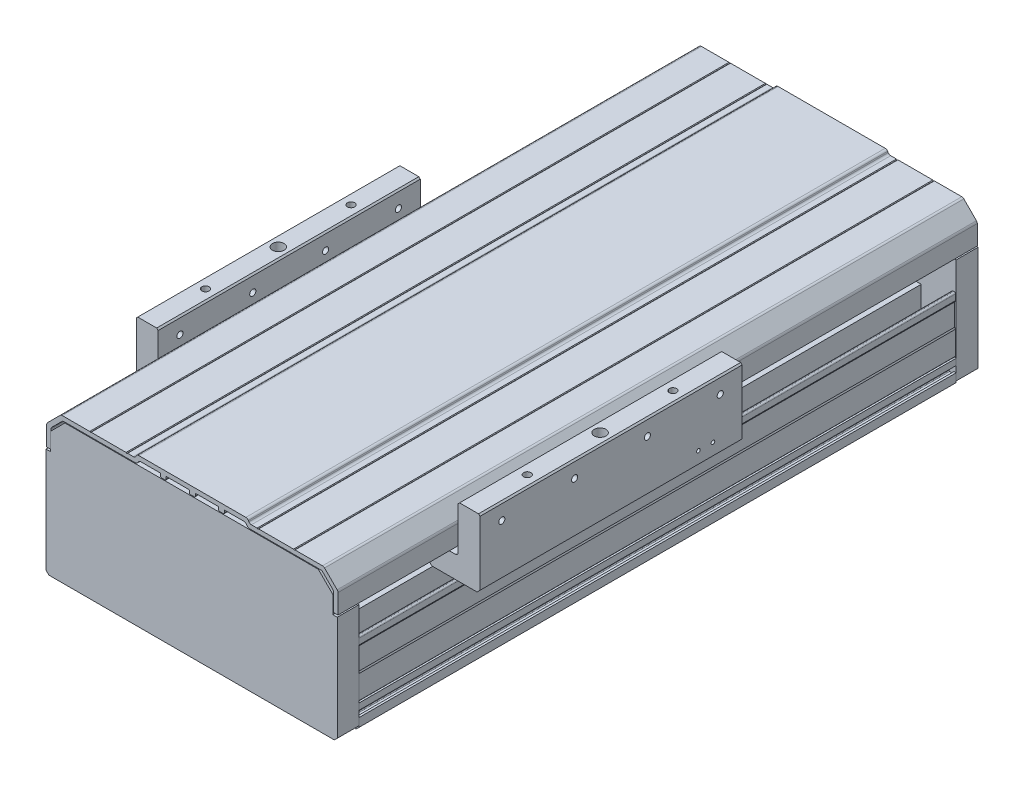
from build123d import *

# Parameters (mm, degrees)
EXTRUDE_1_DEPTH             = 205
EXTRUDE_2_DEPTH             = 15
EXTRUDE_3_DEPTH             = 15
EXTRUDE_4_DEPTH             = 180
EXTRUDE_5_DEPTH             = 219.5
HOLE_WIZARD_M8_1_AT_2_COUNT = 2
HOLE_WIZARD_M8_1_AT_2_PITCH = 173
PATTERN_LINEAR_1_COUNT      = 2
PATTERN_LINEAR_1_PITCH      = 240
HOLE_WIZARD_M6_1_AT_2_COUNT = 2
HOLE_WIZARD_M6_1_AT_2_PITCH = 100
HOLE_WIZARD_M5_1_AT_2_COUNT = 2
HOLE_WIZARD_M5_1_AT_2_PITCH = 50
HOLE_WIZARD_M5_1_AT_3_COUNT = 2
HOLE_WIZARD_M5_1_AT_3_PITCH = 100
HOLE_WIZARD_M5_1_AT_4_COUNT = 2
HOLE_WIZARD_M5_1_AT_4_PITCH = 150
SKETCH_13_R                 = 2.5
CUT_EXTRUDE_1_DEPTH         = 47
SKETCH_14_R                 = 4
CUT_EXTRUDE_2_DEPTH         = 18
HOLE_WIZARD_M3_1_AT_2_COUNT = 2
HOLE_WIZARD_M3_1_AT_2_PITCH = 10


with BuildPart() as part:
    # Sketch 1 → Extrude 1 (new, symmetric)
    # profile 1 of 3: a face of its own
    with BuildSketch(Plane.XY):
        with BuildLine():
            Line((-99, 33.5), (-99, 48.5))
            Line((-99, 48.5), (-99.5, 49.5))
            Line((-99.5, 49.5), (-99.5, 53.5))
            ThreePointArc((-99.5, 53.5), (-99.207106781, 54.207106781), (-98.5, 54.5))
            Line((-98.5, 54.5), (-98, 54.5))
            ThreePointArc((-98, 54.5), (-97.292893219, 54.207106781), (-97, 53.5))
            Line((-97, 53.5), (-97, 16.5))
            ThreePointArc((-97, 16.5), (-97.146446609, 16.146446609), (-97.5, 16))
            Line((-97.5, 16), (-99, 16))
            ThreePointArc((-99, 16), (-99.353553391, 16.146446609), (-99.5, 16.5))
            Line((-99.5, 16.5), (-99.5, 32.5))
            Line((-99.5, 32.5), (-99, 33.5))
        make_face()
    # profile 2 of 3: a face of its own
    with BuildSketch(Plane.XY):
        with BuildLine():
            Line((99, 33.5), (99, 48.5))
            Line((99, 48.5), (99.5, 49.5))
            Line((99.5, 49.5), (99.5, 53.5))
            ThreePointArc((99.5, 53.5), (99.207106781, 54.207106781), (98.5, 54.5))
            Line((98.5, 54.5), (98, 54.5))
            ThreePointArc((98, 54.5), (97.292893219, 54.207106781), (97, 53.5))
            Line((97, 53.5), (97, 16.5))
            ThreePointArc((97, 16.5), (97.146446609, 16.146446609), (97.5, 16))
            Line((97.5, 16), (99, 16))
            ThreePointArc((99, 16), (99.353553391, 16.146446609), (99.5, 16.5))
            Line((99.5, 16.5), (99.5, 32.5))
            Line((99.5, 32.5), (99, 33.5))
        make_face()
    # profile 3 of 3: a face of its own
    with BuildSketch(Plane.XY):
        with BuildLine():
            Line((-78, 44.5), (-43.5, 44.5))
            Line((-43.5, 44.5), (-43.5, 22.499959))
            ThreePointArc((-43.5, 22.499959), (-42.035533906, 18.964425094), (-38.5, 17.499959))
            Line((-38.5, 17.499959), (-38.5, 16.499959))
            Line((-38.5, 16.499959), (-22.9999959, 16.499959))
            Line((-22.9999959, 16.499959), (-22.5, 15.999959))
            Line((-22.5, 15.999959), (22.5, 15.999959))
            Line((22.5, 15.999959), (22.9999959, 16.499959))
            Line((22.9999959, 16.499959), (38.5, 16.499959))
            Line((38.5, 16.499959), (38.5, 17.499959))
            ThreePointArc((38.5, 17.499959), (42.035533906, 18.964425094), (43.5, 22.499959))
            Line((43.5, 22.499959), (43.5, 44.5))
            Line((43.5, 44.5), (71, 44.5))
            Line((71, 44.5), (71, 47.5))
            Line((71, 47.5), (76, 47.5))
            Line((76, 47.5), (76, 31.4999))
            Line((76, 31.4999), (76.3, 31.4999))
            Line((76.3, 31.4999), (76.3, 24.58099761))
            ThreePointArc((76.3, 24.58099761), (76.246719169, 24.583200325), (76.193631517, 24.588240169))
            ThreePointArc((76.193631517, 24.588240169), (74.617365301, 22.19481599), (77.476923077, 22.384615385))
            ThreePointArc((77.476923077, 22.384615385), (77.845299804, 22.832050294), (78.4, 23))
            Line((78.4, 23), (80.8, 23))
            Line((80.8, 23), (81, 22.8))
            Line((81, 22.8), (81, 21.2))
            Line((81, 21.2), (80.8, 21))
            Line((80.8, 21), (79.5, 21))
            Line((79.5, 21), (79.5, 18))
            Line((79.5, 18), (93.5, 18))
            Line((93.5, 18), (93.5, 21))
            Line((93.5, 21), (92.2, 21))
            Line((92.2, 21), (92, 21.2))
            Line((92, 21.2), (92, 22.8))
            Line((92, 22.8), (92.2, 23))
            Line((92.2, 23), (94, 23))
            ThreePointArc((94, 23), (94.707106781, 23.292893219), (95, 24))
            Line((95, 24), (95, 25.5))
            Line((95, 25.5), (97, 25.5))
            Line((97, 25.5), (97, 22.000000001))
            Line((97, 22.000000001), (96.7, 21.5))
            Line((96.7, 21.5), (97, 21))
            Line((97, 21), (97, 15.5))
            Line((97, 15.5), (100, 15.5))
            Line((100, 15.5), (99.999985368, 11.15))
            Line((99.999985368, 11.15), (98.499985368, 11.15))
            Line((98.499985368, 11.15), (98.499985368, 12.65))
            Line((98.499985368, 12.65), (95.499985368, 12.65))
            ThreePointArc((95.499985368, 12.65), (95.146431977, 12.503553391), (94.999985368, 12.15))
            Line((94.999985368, 12.15), (94.999985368, 5.85))
            ThreePointArc((94.999985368, 5.85), (95.146431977, 5.496446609), (95.499985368, 5.35))
            Line((95.499985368, 5.35), (98.499985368, 5.35))
            Line((98.499985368, 5.35), (98.499985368, 6.85))
            Line((98.499985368, 6.85), (99.999985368, 6.85))
            Line((99.999985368, 6.85), (100, 1))
            Line((100, 1), (98, -1))
            Line((98, -1), (36, -1))
            Line((36, -1), (35, 0))
            Line((35, 0), (-35, 0))
            Line((-35, 0), (-36, -1))
            Line((-36, -1), (-98, -1))
            Line((-98, -1), (-100, 1))
            Line((-100, 1), (-99.999985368, 6.85))
            Line((-99.999985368, 6.85), (-98.499985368, 6.85))
            Line((-98.499985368, 6.85), (-98.499985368, 5.35))
            Line((-98.499985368, 5.35), (-95.499985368, 5.35))
            ThreePointArc((-95.499985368, 5.35), (-95.146431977, 5.496446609), (-94.999985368, 5.85))
            Line((-94.999985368, 5.85), (-94.999985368, 12.15))
            ThreePointArc((-94.999985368, 12.15), (-95.146431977, 12.503553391), (-95.499985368, 12.65))
            Line((-95.499985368, 12.65), (-98.499985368, 12.65))
            Line((-98.499985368, 12.65), (-98.499985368, 11.15))
            Line((-98.499985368, 11.15), (-99.999985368, 11.15))
            Line((-99.999985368, 11.15), (-100, 15.5))
            Line((-100, 15.5), (-97, 15.5))
            Line((-97, 15.5), (-97, 21))
            Line((-97, 21), (-96.7, 21.5))
            Line((-96.7, 21.5), (-97, 22))
            Line((-97, 22), (-97, 25.5))
            Line((-97, 25.5), (-95, 25.5))
            Line((-95, 25.5), (-95, 24))
            ThreePointArc((-95, 24), (-94.707106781, 23.292893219), (-94, 23))
            Line((-94, 23), (-92.2, 23))
            Line((-92.2, 23), (-92, 22.8))
            Line((-92, 22.8), (-92, 21.2))
            Line((-92, 21.2), (-92.2, 21))
            Line((-92.2, 21), (-93.5, 21))
            Line((-93.5, 21), (-93.5, 18))
            Line((-93.5, 18), (-79.5, 18))
            Line((-79.5, 18), (-79.5, 21))
            Line((-79.5, 21), (-80.8, 21))
            Line((-80.8, 21), (-81, 21.2))
            Line((-81, 21.2), (-81, 22.8))
            Line((-81, 22.8), (-80.8, 23))
            Line((-80.8, 23), (-78.4, 23))
            ThreePointArc((-78.4, 23), (-77.845299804, 22.832050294), (-77.476923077, 22.384615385))
            ThreePointArc((-77.476923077, 22.384615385), (-74.617365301, 22.19481599), (-76.193631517, 24.588240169))
            ThreePointArc((-76.193631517, 24.588240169), (-76.76123201, 24.686146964), (-77.180676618, 25.080890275))
            Line((-77.180676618, 25.080890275), (-78, 26.5))
            Line((-78, 26.5), (-78, 36.5))
            Line((-78, 36.5), (-77.7, 37))
            Line((-77.7, 37), (-78, 37.5))
            Line((-78, 37.5), (-78, 44.5))
        make_face()
        with BuildLine():
            Line((-66.55, 32.5), (-54.5, 32.5))
            ThreePointArc((-54.5, 32.5), (-53.085786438, 31.914213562), (-52.5, 30.5))
            Line((-52.5, 30.5), (-52.5, 16.25))
            ThreePointArc((-52.5, 16.25), (-52.353553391, 15.896446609), (-52, 15.75))
            Line((-52, 15.75), (-51.407878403, 15.75))
            ThreePointArc((-51.407878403, 15.75), (-51.235654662, 15.780597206), (-51.084509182, 15.868644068))
            ThreePointArc((-51.084509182, 15.868644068), (-47.054594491, 13.850026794), (-51.300978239, 12.338983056))
            ThreePointArc((-51.300978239, 12.338983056), (-51.467890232, 12.457980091), (-51.668524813, 12.5))
            Line((-51.668524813, 12.5), (-67.5, 12.5))
            ThreePointArc((-67.5, 12.5), (-68.914213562, 13.085786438), (-69.5, 14.5))
            Line((-69.5, 14.5), (-69.5, 30.092681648))
            ThreePointArc((-69.5, 30.092681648), (-69.617656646, 30.414882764), (-69.915254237, 30.58544747))
            ThreePointArc((-69.915254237, 30.58544747), (-71.07878547, 34.873482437), (-67.05, 33))
            ThreePointArc((-67.05, 33), (-66.903553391, 32.646446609), (-66.55, 32.5))
        make_face(mode=Mode.SUBTRACT)
        with BuildLine():
            Line((-16.901923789, 9.5), (-14.303847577, 11))
            Line((-14.303847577, 11), (-7.333333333, 11))
            Line((-7.333333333, 11), (-4, 9))
            Line((-4, 9), (4, 9))
            Line((4, 9), (7.333333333, 11))
            Line((7.333333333, 11), (14.303847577, 11))
            Line((14.303847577, 11), (16.901923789, 9.5))
            Line((16.901923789, 9.5), (18.062862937, 9.5))
            ThreePointArc((18.062862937, 9.5), (22.45, 8), (18.062862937, 6.5))
            Line((18.062862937, 6.5), (16.901923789, 6.5))
            Line((16.901923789, 6.5), (14.303847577, 5))
            Line((14.303847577, 5), (-14.303847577, 5))
            Line((-14.303847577, 5), (-16.901923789, 6.5))
            Line((-16.901923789, 6.5), (-18.062862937, 6.5))
            ThreePointArc((-18.062862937, 6.5), (-22.45, 8), (-18.062862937, 9.5))
            Line((-18.062862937, 9.5), (-16.901923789, 9.5))
        make_face(mode=Mode.SUBTRACT)
        with BuildLine():
            Line((66.549999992, 32.500000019), (54.499999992, 32.500000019))
            ThreePointArc((54.499999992, 32.500000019), (53.085786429, 31.914213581), (52.499999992, 30.500000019))
            Line((52.499999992, 30.500000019), (52.499999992, 16.250000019))
            ThreePointArc((52.499999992, 16.250000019), (52.353553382, 15.896446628), (51.999999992, 15.750000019))
            Line((51.999999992, 15.750000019), (51.407878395, 15.750000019))
            ThreePointArc((51.407878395, 15.750000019), (51.235654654, 15.780597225), (51.084509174, 15.868644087))
            ThreePointArc((51.084509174, 15.868644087), (47.054594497, 13.850026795), (51.30097824, 12.338983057))
            ThreePointArc((51.30097824, 12.338983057), (51.467890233, 12.457980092), (51.668524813, 12.5))
            Line((51.668524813, 12.5), (67.5, 12.5))
            ThreePointArc((67.5, 12.5), (68.914213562, 13.085786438), (69.5, 14.5))
            Line((69.5, 14.5), (69.5, 30.092681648))
            ThreePointArc((69.5, 30.092681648), (69.617656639, 30.414882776), (69.915254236, 30.585447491))
            ThreePointArc((69.915254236, 30.585447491), (71.078785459, 34.873482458), (67.049999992, 33.000000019))
            ThreePointArc((67.049999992, 33.000000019), (66.903553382, 32.646446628), (66.549999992, 32.500000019))
        make_face(mode=Mode.SUBTRACT)
    extrude(amount=EXTRUDE_1_DEPTH, both=True)

    # Sketch 7 → Hole Wizard M8 _ _ _ _1 (revolve, cut)
    with BuildSketch(Plane(origin=(-86.5, 18, 120), x_dir=(0, 0, 1), z_dir=(1, 0, 0))):
        Polygon((0, 0), (0, 19), (4.5, 19), (4.5, 9), (7, 9), (7, 0), align=None)
    hole_wizard_m8_1 = revolve(axis=Axis((-86.5, 24.35, 120), (0, -1, 0)), mode=Mode.SUBTRACT)

    # Hole Wizard M8 _ _ _ _1 at 2: Hole Wizard M8 _ _ _ _1 ×2
    with Locations(*[(i * HOLE_WIZARD_M8_1_AT_2_PITCH, 0, 0) for i in range(1, HOLE_WIZARD_M8_1_AT_2_COUNT)]):
        add(hole_wizard_m8_1, mode=Mode.SUBTRACT)

    # Pattern Linear 1: Hole Wizard M8 _ _ _ _1 ×2
    with Locations(*[(0, 0, -i * PATTERN_LINEAR_1_PITCH) for i in range(1, PATTERN_LINEAR_1_COUNT)]):
        add(hole_wizard_m8_1, mode=Mode.SUBTRACT)

    # Pattern Linear 1 copy 1 sketch → Pattern Linear 1 copy 1 (revolve, cut)
    with BuildSketch(Plane(origin=(86.5, 18, -120), x_dir=(0, 0, 1), z_dir=(1, 0, 0))):
        Polygon((0, 0), (0, 19), (4.5, 19), (4.5, 9), (7, 9), (7, 0), align=None)
    revolve(axis=Axis((86.5, 24.35, -120), (0, -1, 0)), mode=Mode.SUBTRACT)


with BuildPart() as body_2:
    # Sketch 2 → Extrude 2 (new body)
    with BuildSketch(Plane.XY.offset(205)):
        Polygon((97.000014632, 86.000015), (87.000014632, 96.000015), (-86.999985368, 96.000015), (-96.999985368, 86.000015), (-96.999985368, 74), (-99.999985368, 74), (-99.999985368, 2), (-97.999985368, 0), (97.999985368, 0), (100.000014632, 2.000029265), (100.000014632, 74), (97.000014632, 74), align=None)
    extrude(amount=EXTRUDE_2_DEPTH)


with BuildPart() as body_3:
    # Sketch 3 → Extrude 3 (new body)
    with BuildSketch(Plane(origin=(0, 0, -205), x_dir=(-1, 0, 0), z_dir=(0, 0, -1))):
        Polygon((97.000014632, 86.000015), (87.000014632, 96.000015), (-86.999985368, 96.000015), (-96.999985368, 86.000015), (-96.999985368, 74), (-99.999985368, 74), (-99.999985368, 2), (-97.999985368, 0), (97.999985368, 0), (100.000014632, 2.000029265), (100.000014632, 74), (97.000014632, 74), align=None)
    extrude(amount=EXTRUDE_3_DEPTH)


with BuildPart() as body_4:
    # Sketch 4 → Extrude 4 (new body)
    with BuildSketch(Plane.XY.offset(140)):
        with BuildLine():
            ThreePointArc((-103, 74), (-102.414213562, 72.585786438), (-101, 72))
            Line((-101, 72), (-96, 72))
            ThreePointArc((-96, 72), (-94.585786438, 72.585786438), (-94, 74))
            Line((-94, 74), (-94, 77.5))
            ThreePointArc((-94, 77.5), (-91.071067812, 84.571067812), (-84, 87.5))
            Line((-84, 87.5), (-58.5, 87.5))
            Line((-58.5, 87.5), (-56.5, 89.5))
            Line((-56.5, 89.5), (56.5, 89.5))
            Line((56.5, 89.5), (58.5, 87.5))
            Line((58.5, 87.5), (84, 87.5))
            ThreePointArc((84, 87.5), (91.071067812, 84.571067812), (94, 77.5))
            Line((94, 77.5), (94, 74))
            ThreePointArc((94, 74), (94.585786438, 72.585786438), (96, 72))
            Line((96, 72), (101, 72))
            ThreePointArc((101, 72), (102.414213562, 72.585786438), (103, 74))
            Line((103, 74), (103, 103))
            Line((103, 103), (104, 104))
            Line((104, 104), (117, 104))
            Line((117, 104), (118, 103))
            Line((118, 103), (118, 59))
            Line((118, 59), (116, 57))
            Line((116, 57), (85, 57))
            Line((85, 57), (83, 59))
            Line((83, 59), (83, 72.5))
            Line((83, 72.5), (-83, 72.5))
            Line((-83, 72.5), (-83, 59))
            Line((-83, 59), (-85, 57))
            Line((-85, 57), (-116, 57))
            Line((-116, 57), (-118, 59))
            Line((-118, 59), (-118, 103))
            Line((-118, 103), (-117, 104))
            Line((-117, 104), (-104, 104))
            Line((-104, 104), (-103, 103))
            Line((-103, 103), (-103, 74))
        make_face()
    extrude(amount=-EXTRUDE_4_DEPTH)

    # Sketch 9 → Hole Wizard M6 _ _1 (revolve, cut)
    with BuildSketch(Plane(origin=(110.5, 104, 100), x_dir=(0, 0, 1), z_dir=(1, 0, 0))):
        Polygon((0, 0), (0, 24.502151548), (2.5, 23), (2.5, 0), align=None)
    hole_wizard_m6_1 = revolve(axis=Axis((110.5, 110.35, 100), (0, -1, 0)), mode=Mode.SUBTRACT)

    # Hole Wizard M6 _ _1 at 2: Hole Wizard M6 _ _1 ×2
    with Locations(*[(0, 0, -i * HOLE_WIZARD_M6_1_AT_2_PITCH) for i in range(1, HOLE_WIZARD_M6_1_AT_2_COUNT)]):
        add(hole_wizard_m6_1, mode=Mode.SUBTRACT)

    # Sketch 11 → Hole Wizard M5 _ _1 (revolve, cut)
    with BuildSketch(Plane(origin=(118, 93, 125), x_dir=(0, 0, -1), z_dir=(0, 1, 0))):
        Polygon((0, 0), (0, 17.2618073), (2.1, 16), (2.1, 0), align=None)
    hole_wizard_m5_1 = revolve(axis=Axis((124.35, 93, 125), (-1, 0, 0)), mode=Mode.SUBTRACT)

    # Hole Wizard M5 _ _1 at 2: Hole Wizard M5 _ _1 ×2
    with Locations(*[(0, 0, -i * HOLE_WIZARD_M5_1_AT_2_PITCH) for i in range(1, HOLE_WIZARD_M5_1_AT_2_COUNT)]):
        add(hole_wizard_m5_1, mode=Mode.SUBTRACT)

    # Hole Wizard M5 _ _1 at 3: Hole Wizard M5 _ _1 ×2
    with Locations(*[(0, 0, -i * HOLE_WIZARD_M5_1_AT_3_PITCH) for i in range(1, HOLE_WIZARD_M5_1_AT_3_COUNT)]):
        add(hole_wizard_m5_1, mode=Mode.SUBTRACT)

    # Hole Wizard M5 _ _1 at 4: Hole Wizard M5 _ _1 ×2
    with Locations(*[(0, 0, -i * HOLE_WIZARD_M5_1_AT_4_PITCH) for i in range(1, HOLE_WIZARD_M5_1_AT_4_COUNT)]):
        add(hole_wizard_m5_1, mode=Mode.SUBTRACT)

    # Sketch 13 → Cut-Extrude 1 (cut)
    with BuildSketch(Plane(origin=(0, 104, 0), x_dir=(1, 0, 0), z_dir=(0, 1, 0))):
        with Locations(Location((110.5, -50, 0), (0, 0, 270))):
            Circle(SKETCH_13_R)
    cut_extrude_1 = extrude(amount=-CUT_EXTRUDE_1_DEPTH, mode=Mode.SUBTRACT)

    # Sketch 14 → Cut-Extrude 2 (cut)
    with BuildSketch(Plane(origin=(0, 104, 0), x_dir=(1, 0, 0), z_dir=(0, 1, 0))):
        with Locations(Location((110.5, -50, 0), (0, 0, 270))):
            Circle(SKETCH_14_R)
    cut_extrude_2 = extrude(amount=-CUT_EXTRUDE_2_DEPTH, mode=Mode.SUBTRACT)

    # Mirror 1: Hole Wizard M6 _ _1, Hole Wizard M5 _ _1, Cut-Extrude 1, Cut-Extrude 2 across plane
    add(hole_wizard_m6_1.mirror(Plane(origin=(0, 0, 0), x_dir=(0, 0, 1), z_dir=(1, 0, 0))), mode=Mode.SUBTRACT)
    add(hole_wizard_m5_1.mirror(Plane(origin=(0, 0, 0), x_dir=(0, 0, 1), z_dir=(1, 0, 0))), mode=Mode.SUBTRACT)
    add(cut_extrude_1.mirror(Plane(origin=(0, 0, 0), x_dir=(0, 0, 1), z_dir=(1, 0, 0))), mode=Mode.SUBTRACT)
    add(cut_extrude_2.mirror(Plane(origin=(0, 0, 0), x_dir=(0, 0, 1), z_dir=(1, 0, 0))), mode=Mode.SUBTRACT)

    # Mirror 1 copy 1 sketch → Mirror 1 copy 1 (revolve, cut)
    with BuildSketch(Plane(origin=(-110.5, 104, 0), x_dir=(0, 0, 1), z_dir=(-1, 0, 0))):
        Polygon((0, 0), (0, -24.502151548), (2.5, -23), (2.5, 0), align=None)
    revolve(axis=Axis((-110.5, 110.35, 0), (0, 1, 0)), mode=Mode.SUBTRACT)

    # Mirror 1 copy 2 sketch → Mirror 1 copy 2 (revolve, cut)
    with BuildSketch(Plane(origin=(-118, 93, 75), x_dir=(0, 0, -1), z_dir=(0, 1, 0))):
        Polygon((0, 0), (0, -17.2618073), (2.1, -16), (2.1, 0), align=None)
    revolve(axis=Axis((-124.35, 93, 75), (-1, 0, 0)), mode=Mode.SUBTRACT)

    # Mirror 1 copy 3 sketch → Mirror 1 copy 3 (revolve, cut)
    with BuildSketch(Plane(origin=(-118, 93, 25), x_dir=(0, 0, -1), z_dir=(0, 1, 0))):
        Polygon((0, 0), (0, -17.2618073), (2.1, -16), (2.1, 0), align=None)
    revolve(axis=Axis((-124.35, 93, 25), (-1, 0, 0)), mode=Mode.SUBTRACT)

    # Mirror 1 copy 4 sketch → Mirror 1 copy 4 (revolve, cut)
    with BuildSketch(Plane(origin=(-118, 93, -25), x_dir=(0, 0, -1), z_dir=(0, 1, 0))):
        Polygon((0, 0), (0, -17.2618073), (2.1, -16), (2.1, 0), align=None)
    revolve(axis=Axis((-124.35, 93, -25), (-1, 0, 0)), mode=Mode.SUBTRACT)

    # Sketch 15 → Hole Wizard M3 _ _1 (revolve, cut)
    with BuildSketch(Plane(origin=(118, 67, -20), x_dir=(0, 0, -1), z_dir=(0, 1, 0))):
        Polygon((0, 0), (0, 13.251075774), (1.25, 12.5), (1.25, 0), align=None)
    hole_wizard_m3_1 = revolve(axis=Axis((124.35, 67, -20), (-1, 0, 0)), mode=Mode.SUBTRACT)

    # Hole Wizard M3 _ _1 at 2: Hole Wizard M3 _ _1 ×2
    with Locations(*[(0, 0, i * HOLE_WIZARD_M3_1_AT_2_PITCH) for i in range(1, HOLE_WIZARD_M3_1_AT_2_COUNT)]):
        add(hole_wizard_m3_1, mode=Mode.SUBTRACT)

    # Mirror 2: Hole Wizard M3 _ _1 across plane
    add(hole_wizard_m3_1.mirror(Plane(origin=(0, 0, 0), x_dir=(0, 0, 1), z_dir=(1, 0, 0))), mode=Mode.SUBTRACT)

    # Mirror 2 copy 1 sketch → Mirror 2 copy 1 (revolve, cut)
    with BuildSketch(Plane(origin=(-118, 67, -10), x_dir=(0, 0, -1), z_dir=(0, 1, 0))):
        Polygon((0, 0), (0, -13.251075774), (1.25, -12.5), (1.25, 0), align=None)
    revolve(axis=Axis((-124.35, 67, -10), (-1, 0, 0)), mode=Mode.SUBTRACT)


with BuildPart() as body_5:
    # Sketch 5 → Extrude 5 (new, symmetric)
    with BuildSketch(Plane.XY):
        with BuildLine():
            Line((36.749407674, 101.5), (-36.749407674, 101.5))
            ThreePointArc((-36.749407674, 101.5), (-37.719816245, 101.248801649), (-38.446459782, 100.558307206))
            Line((-38.446459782, 100.558307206), (-38.830989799, 99.941692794))
            ThreePointArc((-38.830989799, 99.941692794), (-39.557633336, 99.251198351), (-40.528041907, 99))
            Line((-40.528041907, 99), (-44.5, 99))
            Line((-44.5, 99), (-45, 98.7))
            Line((-45, 98.7), (-45.5, 99))
            Line((-45.5, 99), (-69.5, 99))
            Line((-69.5, 99), (-70, 98.7))
            Line((-70, 98.7), (-70.5, 99))
            Line((-70.5, 99), (-89.369129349, 99))
            ThreePointArc((-89.369129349, 99), (-90.134496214, 98.847759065), (-90.783342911, 98.414213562))
            Line((-90.783342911, 98.414213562), (-99.414213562, 89.783342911))
            ThreePointArc((-99.414213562, 89.783342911), (-99.847759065, 89.134496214), (-100, 88.369129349))
            Line((-100, 88.369129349), (-100, 75))
            Line((-100, 75), (-97, 75))
            Line((-97, 75), (-97, 87.126488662))
            ThreePointArc((-97, 87.126488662), (-96.847759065, 87.891855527), (-96.414213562, 88.540702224))
            Line((-96.414213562, 88.540702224), (-89.540702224, 95.414213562))
            ThreePointArc((-89.540702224, 95.414213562), (-88.891855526, 95.847759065), (-88.126488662, 96))
            Line((-88.126488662, 96), (-39.21505842, 96))
            ThreePointArc((-39.21505842, 96), (-38.244649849, 96.251198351), (-37.518006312, 96.941692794))
            Line((-37.518006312, 96.941692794), (-37.133476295, 97.558307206))
            ThreePointArc((-37.133476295, 97.558307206), (-36.406832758, 98.248801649), (-35.436424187, 98.5))
            Line((-35.436424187, 98.5), (-22.25, 98.5))
            ThreePointArc((-22.25, 98.5), (-22.073223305, 98.426776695), (-22, 98.25))
            Line((-22, 98.25), (-22, 96.75))
            ThreePointArc((-22, 96.75), (-21.780330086, 96.219669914), (-21.25, 96))
            Line((-21.25, 96), (-18.75, 96))
            ThreePointArc((-18.75, 96), (-18.219669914, 96.219669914), (-18, 96.75))
            Line((-18, 96.75), (-18, 98.25))
            ThreePointArc((-18, 98.25), (-17.926776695, 98.426776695), (-17.75, 98.5))
            Line((-17.75, 98.5), (-2.25, 98.5))
            ThreePointArc((-2.25, 98.5), (-2.073223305, 98.426776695), (-2, 98.25))
            Line((-2, 98.25), (-2, 96.75))
            ThreePointArc((-2, 96.75), (-1.780330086, 96.219669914), (-1.25, 96))
            Line((-1.25, 96), (1.25, 96))
            ThreePointArc((1.25, 96), (1.780330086, 96.219669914), (2, 96.75))
            Line((2, 96.75), (2, 98.25))
            ThreePointArc((2, 98.25), (2.073223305, 98.426776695), (2.25, 98.5))
            Line((2.25, 98.5), (17.75, 98.5))
            ThreePointArc((17.75, 98.5), (17.926776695, 98.426776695), (18, 98.25))
            Line((18, 98.25), (18, 96.75))
            ThreePointArc((18, 96.75), (18.219669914, 96.219669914), (18.75, 96))
            Line((18.75, 96), (21.25, 96))
            ThreePointArc((21.25, 96), (21.780330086, 96.219669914), (22, 96.75))
            Line((22, 96.75), (22, 98.25))
            ThreePointArc((22, 98.25), (22.073223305, 98.426776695), (22.25, 98.5))
            Line((22.25, 98.5), (35.436424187, 98.5))
            ThreePointArc((35.436424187, 98.5), (36.406832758, 98.248801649), (37.133476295, 97.558307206))
            Line((37.133476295, 97.558307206), (37.518006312, 96.941692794))
            ThreePointArc((37.518006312, 96.941692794), (38.244649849, 96.251198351), (39.21505842, 96))
            Line((39.21505842, 96), (88.126488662, 96))
            ThreePointArc((88.126488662, 96), (88.891855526, 95.847759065), (89.540702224, 95.414213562))
            Line((89.540702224, 95.414213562), (96.414213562, 88.540702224))
            ThreePointArc((96.414213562, 88.540702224), (96.847759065, 87.891855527), (97, 87.126488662))
            Line((97, 87.126488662), (97, 75))
            Line((97, 75), (100, 75))
            Line((100, 75), (100, 88.369129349))
            ThreePointArc((100, 88.369129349), (99.847759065, 89.134496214), (99.414213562, 89.783342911))
            Line((99.414213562, 89.783342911), (90.783342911, 98.414213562))
            ThreePointArc((90.783342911, 98.414213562), (90.134496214, 98.847759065), (89.369129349, 99))
            Line((89.369129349, 99), (70.5, 99))
            Line((70.5, 99), (70, 98.7))
            Line((70, 98.7), (69.5, 99))
            Line((69.5, 99), (45.5, 99))
            Line((45.5, 99), (45, 98.7))
            Line((45, 98.7), (44.5, 99))
            Line((44.5, 99), (40.528041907, 99))
            ThreePointArc((40.528041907, 99), (39.557633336, 99.251198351), (38.830989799, 99.941692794))
            Line((38.830989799, 99.941692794), (38.446459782, 100.558307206))
            ThreePointArc((38.446459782, 100.558307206), (37.719816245, 101.248801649), (36.749407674, 101.5))
        make_face()
    extrude(amount=EXTRUDE_5_DEPTH, both=True)


solid = Compound([part.part, body_2.part, body_3.part, body_4.part, body_5.part])
